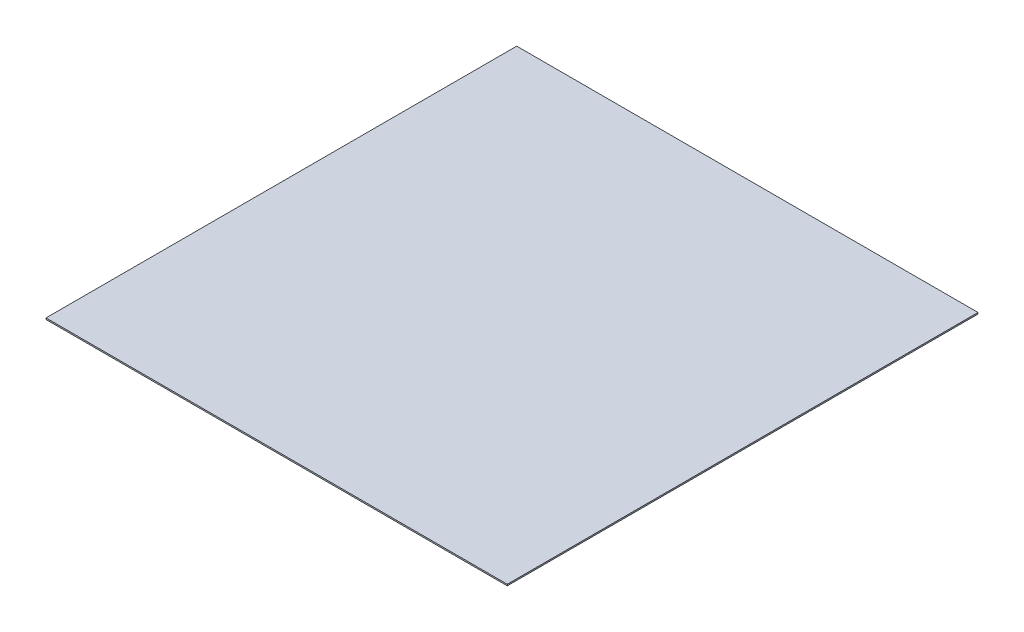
from build123d import *

# Parameters (mm, degrees)
L_U_BR_W             = 980
L_U_BR_H             = 1000
AUFSATZ_LIN_GK_DEPTH = 3


with BuildPart() as part:
    # L_ u Br → Aufsatz-Lin_GK (new body)
    with BuildSketch(Plane(origin=(0, 0, 0), x_dir=(1, 0, 0), z_dir=(0, 1, 0))):
        with Locations((0, -500)):
            Rectangle(L_U_BR_W, L_U_BR_H)
    extrude(amount=AUFSATZ_LIN_GK_DEPTH)


solid = part.part
